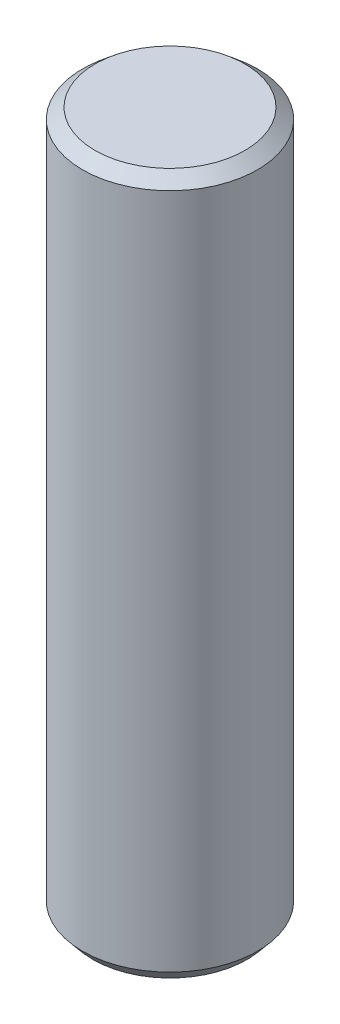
from build123d import *
from OCP.BRepFilletAPI import BRepFilletAPI_MakeChamfer

# Parameters (mm, degrees)
SKETCH1_R           = 2.5
BOSS_EXTRUDE1_DEPTH = 10
CHAMFER1_SIZE       = 0.3
CHAMFER1_SIZE2      = 0.357526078


with BuildPart() as part:
    # Sketch1 → Boss-Extrude1 (new, symmetric)
    with BuildSketch(Plane(origin=(0, 0, 0), x_dir=(1, 0, 0), z_dir=(0, 1, 0))):
        with Locations(Location((0, 0, 0), (0, 0, 270))):
            Circle(SKETCH1_R)
    extrude(amount=BOSS_EXTRUDE1_DEPTH, both=True)

    # Chamfer1: one chamfer whose edges measure the first distance from different faces: ONE call of the kernel's chamfer builder (chamfer() names one face for all edges)
    chamfer1_edges_1 = [part.edges().sort_by_distance(p)[0] for p in [
        (0, -10, -2.5),
    ]]
    chamfer1_side_1 = [part.faces().sort_by_distance(p)[0] for p in [
        (0, -10, 0),
    ]]
    chamfer1_edges_2 = [part.edges().sort_by_distance(p)[0] for p in [
        (0, 10, -2.5),
    ]]
    chamfer1_side_2 = [part.faces().sort_by_distance(p)[0] for p in [
        (0, 0, -2.5),
    ]]
    chamfer1 = BRepFilletAPI_MakeChamfer(part.part.solid().wrapped)
    for e in chamfer1_edges_1:
        chamfer1.Add(CHAMFER1_SIZE, CHAMFER1_SIZE2, e.wrapped, chamfer1_side_1[0].wrapped)  # the first distance lies on this face
    for e in chamfer1_edges_2:
        chamfer1.Add(CHAMFER1_SIZE, CHAMFER1_SIZE2, e.wrapped, chamfer1_side_2[0].wrapped)  # the first distance lies on this face
    add(Compound.cast(chamfer1.Shape()), mode=Mode.REPLACE)


solid = part.part
